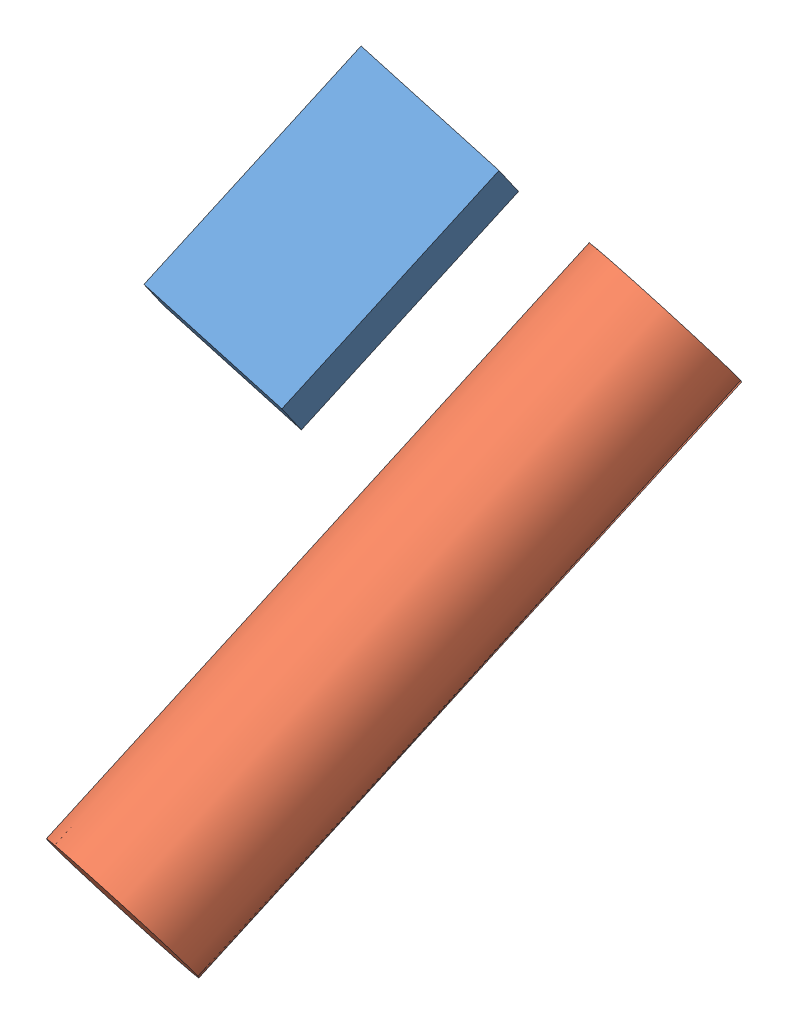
SolidWorks assembly Baugruppe2.SLDASM, configuration Standard (file format 4100). Lengths in mm.
Overall size (495.84 438.35 584.49).
2 component instances, 2 part files, 2 mates.
Components (placement in the parent):
- Teil1-1: Teil1.SLDPRT [Standard] at (-150.6533 74.8279 41.5198) x (0.906862 -0.404993 -0.116542) z (-0.163185 -0.592427 0.788924) size (118.21 79.6 200)
- Teil2-1: Teil2.SLDPRT [Standard] at (135.4225 50.4728 272.5364) x (0.906862 -0.404993 -0.116542) z (-0.163185 -0.592427 0.788924) size (129.05 129.05 500)
Mates (geometry in assembly coordinates):
- Parallel1: parallel: plane of Teil1-1 through (-205.1068 67.2388 151.3123) normal (0.388551 0.696428 0.603338); plane of Teil2-1
- Deckungsgleich2: coincident aligned: plane of Teil1-1 through (-96.1998 82.4171 -68.2727) normal (0.163185 0.592427 -0.788924); plane of Teil2-1 through (176.2187 198.5795 75.3054) normal (0.163185 0.592427 -0.788924)
